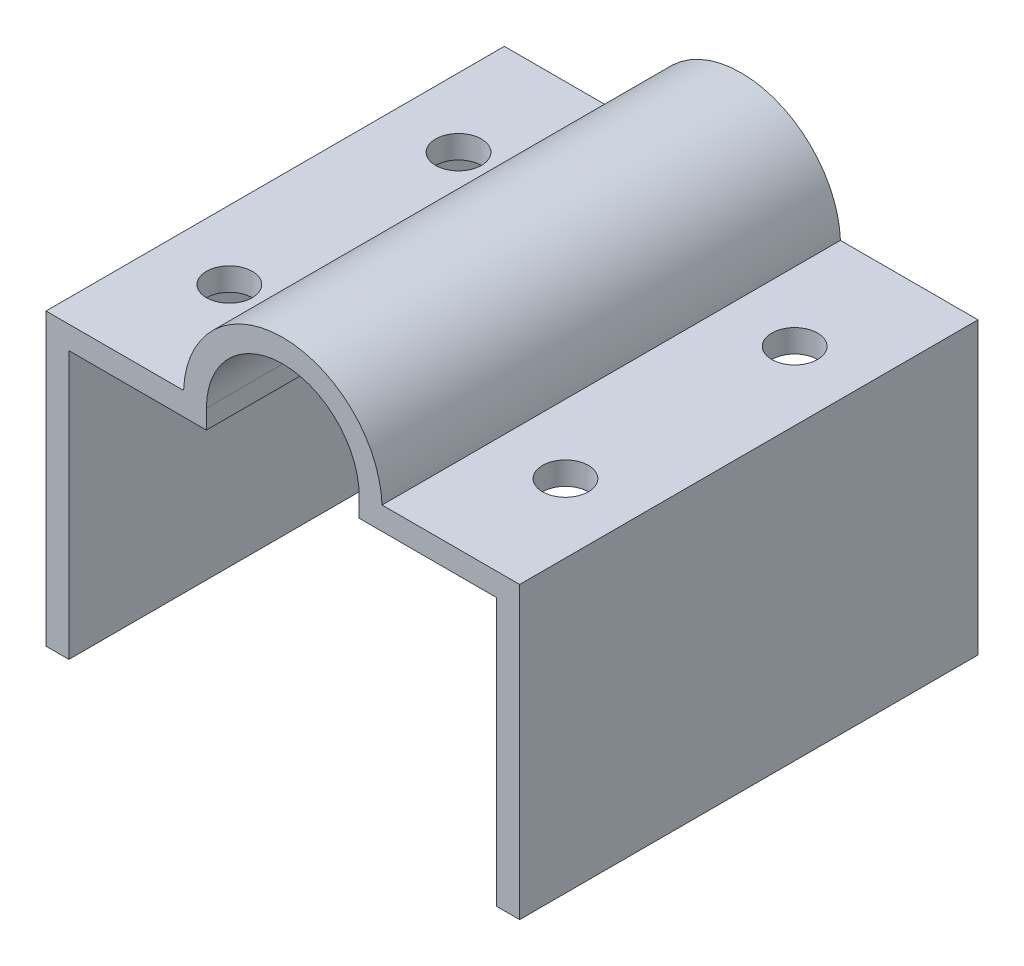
from build123d import *

# Parameters (mm, degrees)
EXTRUSION1_DEPTH = 30
D_GAGEMENT_M61_D = 6


with BuildPart() as part:
    # Esquisse1 → Extrusion1 (new, symmetric)
    with BuildSketch(Plane.XY):
        with BuildLine():
            Line((-28, 0), (-28, 35))
            Line((-28, 35), (-10, 35))
            Line((-10, 35), (-10, 37.5))
            ThreePointArc((-10, 37.5), (0, 47.5), (10, 37.5))
            Line((10, 37.5), (10, 35))
            Line((10, 35), (28, 35))
            Line((28, 35), (28, 0))
            Line((28, 0), (31, 0))
            Line((31, 0), (31, 38))
            Line((31, 38), (12.990381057, 38))
            ThreePointArc((12.990381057, 38), (0, 50.5), (-12.990381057, 38))
            Line((-12.990381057, 38), (-31, 38))
            Line((-31, 38), (-31, 0))
            Line((-31, 0), (-28, 0))
        make_face()
    extrude(amount=EXTRUSION1_DEPTH, both=True)

    # D_gagement M61 (through all)
    with Locations(Plane(origin=(0, 38, 0), x_dir=(-1, 0, 0), z_dir=(0, 1, 0))):
        with Locations((22, 15), (22, -15), (-22, -15), (-22, 15)):
            Hole(D_GAGEMENT_M61_D / 2)


solid = part.part
